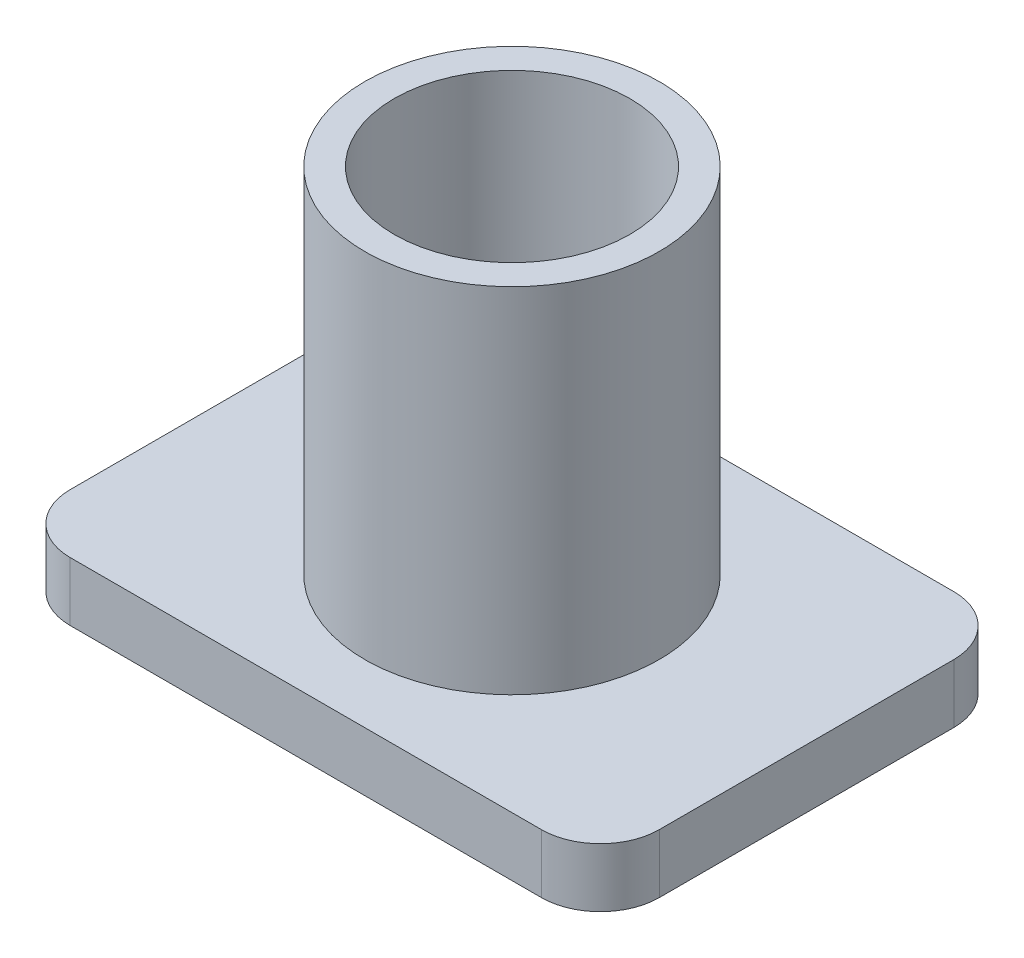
from build123d import *

# Parameters (mm, degrees)
SKETCH1_W           = 50
SKETCH1_H           = 35
EXTRUDE1_DEPTH      = 5
SKETCH2_R           = 12.5
SKETCH2_R_2         = 10
EXTRUDE_THIN1_DEPTH = 30
FILLET1_R           = 5


with BuildPart() as part:
    # Sketch1 → Extrude1 (new body)
    with BuildSketch(Plane(origin=(0, 0, 0), x_dir=(1, 0, 0), z_dir=(0, 1, 0))):
        Rectangle(SKETCH1_W, SKETCH1_H)
    extrude(amount=EXTRUDE1_DEPTH)

    # Sketch2 → Extrude-Thin1 (add)
    with BuildSketch(Plane(origin=(0, 5, 0), x_dir=(-1, 0, 0), z_dir=(0, 1, 0))):
        Circle(SKETCH2_R)
        Circle(SKETCH2_R_2, mode=Mode.SUBTRACT)
    extrude(amount=EXTRUDE_THIN1_DEPTH)

    # Fillet1
    fillet1_edges = [part.edges().sort_by_distance(p)[0] for p in [
        (-25, 2.5, -17.5),
        (25, 2.5, -17.5),
        (25, 2.5, 17.5),
        (-25, 2.5, 17.5),
    ]]
    fillet(fillet1_edges, radius=FILLET1_R)


solid = part.part
